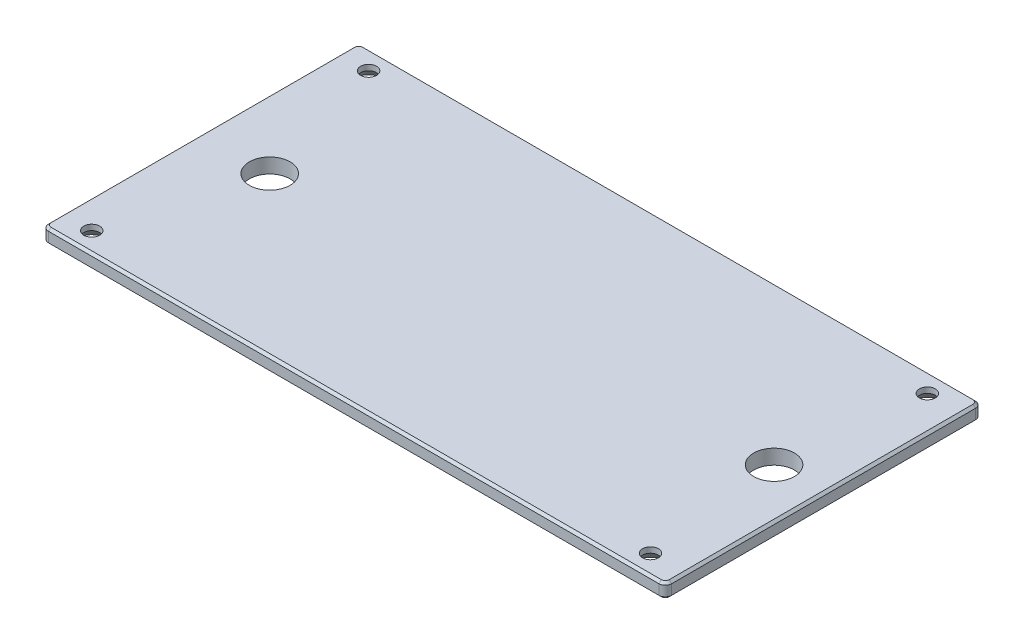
from build123d import *

# Parameters (mm, degrees)
SKETCH1_W                                          = 200.025
SKETCH1_H                                          = 101.6
BOSS_EXTRUDE1_DEPTH                                = 4.7498
CSK_FOR_10_FLAT_HEAD_SOCKET_CAP_SCREW1_D           = 5.1054
CSK_FOR_10_FLAT_HEAD_SOCKET_CAP_SCREW1_DEPTH       = 10.0076
CSK_FOR_10_FLAT_HEAD_SOCKET_CAP_SCREW1_CSINK_D     = 10.2575106
CSK_FOR_10_FLAT_HEAD_SOCKET_CAP_SCREW1_CSINK_ANGLE = 82
CSK_FOR_10_FLAT_HEAD_SOCKET_CAP_SCREW1_TIP         = 2.936545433
HOLE1_D                                            = 13.081
FILLET1_R                                          = 2.032
CHAMFER1_SIZE                                      = 0.762


with BuildPart() as part:
    # Sketch1 → Boss-Extrude1 (new body)
    with BuildSketch(Plane(origin=(0, 0, 0), x_dir=(1, 0, 0), z_dir=(0, 1, 0))):
        with Locations((1.5875, 0)):
            Rectangle(SKETCH1_W, SKETCH1_H)
    extrude(amount=BOSS_EXTRUDE1_DEPTH)

    # CSK for _10 Flat Head Socket Cap Screw1
    with Locations(Plane(origin=(0, 0, 0), x_dir=(-1, 0, 0), z_dir=(0, -1, 0))):
        with Locations((88.9, -44.45), (-90.5002, -44.45), (-90.5002, 44.45), (88.9, 44.45)):
            CounterSinkHole(CSK_FOR_10_FLAT_HEAD_SOCKET_CAP_SCREW1_D / 2, CSK_FOR_10_FLAT_HEAD_SOCKET_CAP_SCREW1_CSINK_D / 2, depth=CSK_FOR_10_FLAT_HEAD_SOCKET_CAP_SCREW1_DEPTH, counter_sink_angle=CSK_FOR_10_FLAT_HEAD_SOCKET_CAP_SCREW1_CSINK_ANGLE)
            with Locations((0, 0, -(CSK_FOR_10_FLAT_HEAD_SOCKET_CAP_SCREW1_DEPTH + CSK_FOR_10_FLAT_HEAD_SOCKET_CAP_SCREW1_TIP / 2))):  # 82° drill point
                Cone(0, CSK_FOR_10_FLAT_HEAD_SOCKET_CAP_SCREW1_D / 2, CSK_FOR_10_FLAT_HEAD_SOCKET_CAP_SCREW1_TIP, mode=Mode.SUBTRACT)

    # Hole1 (through all)
    with Locations(Plane(origin=(0, 0, 0), x_dir=(-1, 0, 0), z_dir=(0, -1, 0))):
        with Locations((76.2, 0), (-85.725, 0)):
            Hole(HOLE1_D / 2)

    # Fillet1
    fillet1_edges = [part.edges().sort_by_distance(p)[0] for p in [
        (-98.425, 2.3749, -50.8),
        (101.6, 2.3749, -50.8),
        (101.6, 2.3749, 50.8),
        (-98.425, 2.3749, 50.8),
    ]]
    fillet(fillet1_edges, radius=FILLET1_R)

    # Chamfer1
    chamfer1_edges = [part.edges().sort_by_distance(p)[0] for p in [
        (-98.425, 0, 0),
        (-98.425, 4.7498, 0),
        (1.5875, 0, -50.8),
        (101.6, 0, 0),
        (1.5875, 0, 50.8),
        (-97.829840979, 0, 50.204840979),
        (101.004840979, 0, 50.204840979),
        (101.004840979, 0, -50.204840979),
        (-97.829840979, 0, -50.204840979),
        (1.5875, 4.7498, -50.8),
        (1.5875, 4.7498, 50.8),
        (101.6, 4.7498, 0),
        (-97.829840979, 4.7498, 50.204840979),
        (101.004840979, 4.7498, 50.204840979),
        (101.004840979, 4.7498, -50.204840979),
        (-97.829840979, 4.7498, -50.204840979),
    ]]
    chamfer(chamfer1_edges, length=CHAMFER1_SIZE)


solid = part.part
